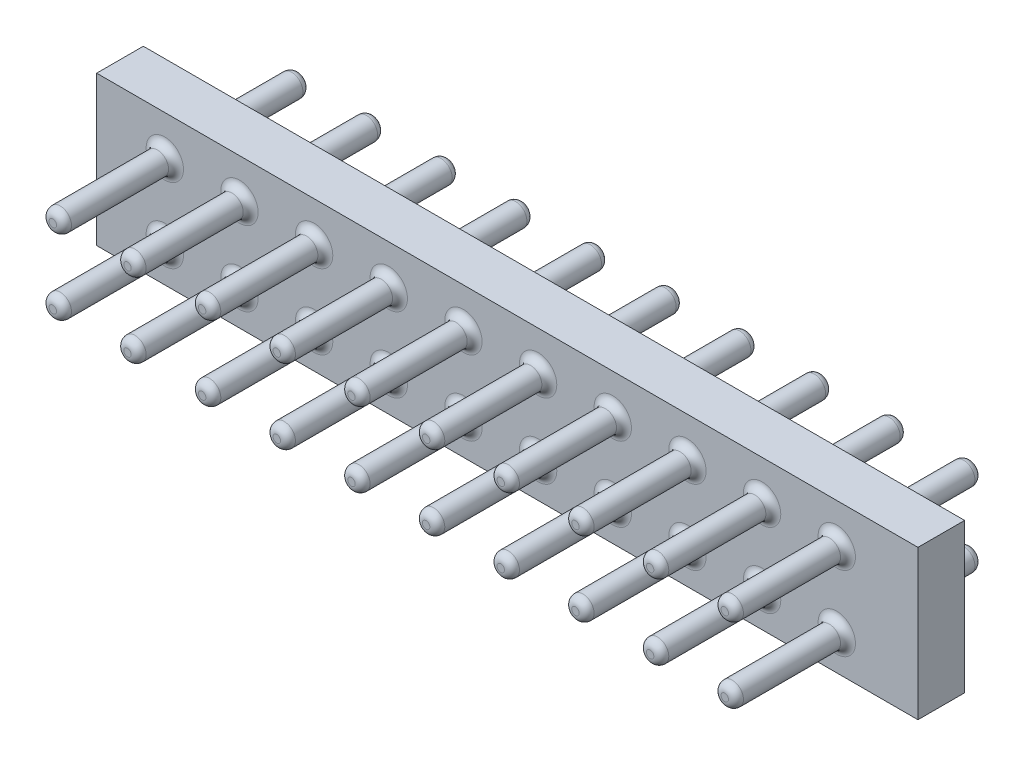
from build123d import *

# Parameters (mm, degrees)
SKETCH1_W            = 27.94
SKETCH1_H            = 5.08
EXTRUDE1_DEPTH       = 1.5875
EXTRUDE2_START       = -4.572
SKETCH2_R            = 0.381
EXTRUDE2_DEPTH       = 8.382
FILLET1_R            = 0.254
LPATTERN2_COUNT      = 10
LPATTERN2_PITCH      = 2.54
LPATTERN2_COUNT_DIR2 = 2
LPATTERN2_PITCH_DIR2 = 2.54
FILLET2_R            = 0.254


with BuildPart() as part:
    # Sketch1 → Extrude1 (new body)
    with BuildSketch(Plane.XY):
        with Locations((-46.414048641, -18.308712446)):
            Rectangle(SKETCH1_W, SKETCH1_H)
    extrude(amount=EXTRUDE1_DEPTH)

    # Sketch2 → Extrude2 (add)
    with BuildSketch(Plane.XY.offset(1.5875).offset(EXTRUDE2_START)):
        with Locations((-58.065304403, -17.124711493)):
            Circle(SKETCH2_R)
    extrude2 = extrude(amount=EXTRUDE2_DEPTH)

    # Fillet1
    fillet1_edges = [part.edges().sort_by_distance(p)[0] for p in [
        (-58.446304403, -17.124711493, 0),
        (-58.446304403, -17.124711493, 1.5875),
        (-58.446304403, -17.124711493, -2.9845),
        (-58.446304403, -17.124711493, 5.3975),
    ]]
    fillet(fillet1_edges, radius=FILLET1_R)

    # LPattern2: Extrude2 10 × 2
    with Locations(*[(i * LPATTERN2_PITCH, -j * LPATTERN2_PITCH_DIR2, 0) for i in range(LPATTERN2_COUNT) for j in range(LPATTERN2_COUNT_DIR2) if (i, j) != (0, 0)]):
        add(extrude2)

    # Fillet2
    fillet2_edges = [part.edges().sort_by_distance(p)[0] for p in [
        (-40.666304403, -17.124711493, 0),
        (-40.666304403, -17.124711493, 1.5875),
        (-40.666304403, -17.124711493, -2.9845),
        (-40.666304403, -17.124711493, 5.3975),
        (-40.666304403, -19.664711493, 0),
        (-40.666304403, -19.664711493, 1.5875),
        (-40.666304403, -19.664711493, -2.9845),
        (-40.666304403, -19.664711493, 5.3975),
        (-38.126304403, -17.124711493, 0),
        (-38.126304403, -17.124711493, 1.5875),
        (-38.126304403, -17.124711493, -2.9845),
        (-38.126304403, -17.124711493, 5.3975),
        (-38.126304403, -19.664711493, 0),
        (-38.126304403, -19.664711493, 1.5875),
        (-38.126304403, -19.664711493, -2.9845),
        (-38.126304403, -19.664711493, 5.3975),
        (-35.586304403, -17.124711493, 0),
        (-35.586304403, -17.124711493, 1.5875),
        (-35.586304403, -17.124711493, -2.9845),
        (-35.586304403, -17.124711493, 5.3975),
        (-35.586304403, -19.664711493, 0),
        (-35.586304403, -19.664711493, 1.5875),
        (-35.586304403, -19.664711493, -2.9845),
        (-35.586304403, -19.664711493, 5.3975),
        (-58.446304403, -19.664711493, 0),
        (-58.446304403, -19.664711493, 1.5875),
        (-58.446304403, -19.664711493, -2.9845),
        (-58.446304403, -19.664711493, 5.3975),
        (-55.906304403, -17.124711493, 0),
        (-55.906304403, -17.124711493, 1.5875),
        (-55.906304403, -17.124711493, -2.9845),
        (-55.906304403, -17.124711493, 5.3975),
        (-55.906304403, -19.664711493, 0),
        (-55.906304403, -19.664711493, 1.5875),
        (-55.906304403, -19.664711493, -2.9845),
        (-55.906304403, -19.664711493, 5.3975),
        (-53.366304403, -17.124711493, 0),
        (-53.366304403, -17.124711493, 1.5875),
        (-53.366304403, -17.124711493, -2.9845),
        (-53.366304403, -17.124711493, 5.3975),
        (-53.366304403, -19.664711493, 0),
        (-53.366304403, -19.664711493, 1.5875),
        (-53.366304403, -19.664711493, -2.9845),
        (-53.366304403, -19.664711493, 5.3975),
        (-50.826304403, -17.124711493, 0),
        (-50.826304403, -17.124711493, 1.5875),
        (-50.826304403, -17.124711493, -2.9845),
        (-50.826304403, -17.124711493, 5.3975),
        (-50.826304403, -19.664711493, 0),
        (-50.826304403, -19.664711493, 1.5875),
        (-50.826304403, -19.664711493, -2.9845),
        (-50.826304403, -19.664711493, 5.3975),
        (-48.286304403, -17.124711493, 0),
        (-48.286304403, -17.124711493, 1.5875),
        (-48.286304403, -17.124711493, -2.9845),
        (-48.286304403, -17.124711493, 5.3975),
        (-48.286304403, -19.664711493, 0),
        (-48.286304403, -19.664711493, 1.5875),
        (-48.286304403, -19.664711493, -2.9845),
        (-48.286304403, -19.664711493, 5.3975),
        (-45.746304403, -17.124711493, 0),
        (-45.746304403, -17.124711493, 1.5875),
        (-45.746304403, -17.124711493, -2.9845),
        (-45.746304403, -17.124711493, 5.3975),
        (-45.746304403, -19.664711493, 0),
        (-45.746304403, -19.664711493, 1.5875),
        (-45.746304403, -19.664711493, -2.9845),
        (-45.746304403, -19.664711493, 5.3975),
        (-43.206304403, -17.124711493, 0),
        (-43.206304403, -17.124711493, 1.5875),
        (-43.206304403, -17.124711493, -2.9845),
        (-43.206304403, -17.124711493, 5.3975),
        (-43.206304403, -19.664711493, 0),
        (-43.206304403, -19.664711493, 1.5875),
        (-43.206304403, -19.664711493, -2.9845),
        (-43.206304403, -19.664711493, 5.3975),
    ]]
    fillet(fillet2_edges, radius=FILLET2_R)


solid = part.part
